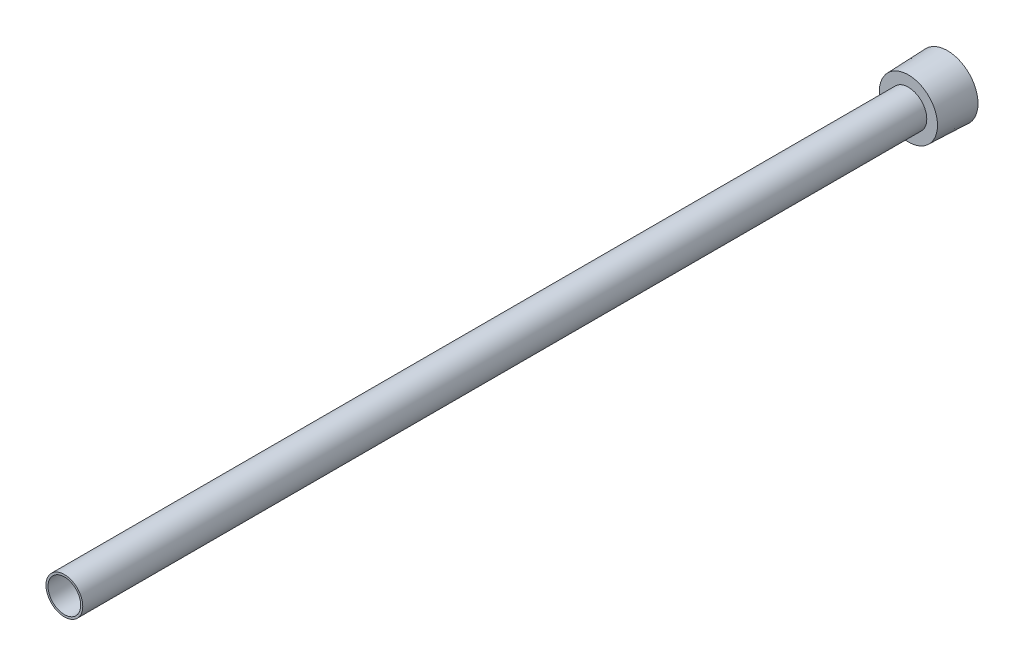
ISO-10303-21;
HEADER;
FILE_DESCRIPTION(('STEP AP214'),'2;1');
FILE_NAME('part.step','',(''),(''),'','','');
FILE_SCHEMA(('AUTOMOTIVE_DESIGN { 1 0 10303 214 1 1 1 1 }'));
ENDSEC;
DATA;
#1=APPLICATION_CONTEXT('core data for automotive mechanical design processes');
#2=APPLICATION_PROTOCOL_DEFINITION('international standard','automotive_design',2000,#1);
#3=PRODUCT_CONTEXT('',#1,'mechanical');
#4=PRODUCT('Part','Part','',(#3));
#5=PRODUCT_RELATED_PRODUCT_CATEGORY('part','',(#4));
#6=PRODUCT_DEFINITION_FORMATION('','',#4);
#7=PRODUCT_DEFINITION_CONTEXT('part definition',#1,'design');
#8=PRODUCT_DEFINITION('design','',#6,#7);
#9=PRODUCT_DEFINITION_SHAPE('','',#8);
#10=(LENGTH_UNIT() NAMED_UNIT(*) SI_UNIT(.MILLI.,.METRE.));
#11=(NAMED_UNIT(*) PLANE_ANGLE_UNIT() SI_UNIT($,.RADIAN.));
#12=(NAMED_UNIT(*) SI_UNIT($,.STERADIAN.) SOLID_ANGLE_UNIT());
#13=UNCERTAINTY_MEASURE_WITH_UNIT(LENGTH_MEASURE(1.E-05),#10,'distance_accuracy_value','');
#14=(GEOMETRIC_REPRESENTATION_CONTEXT(3) GLOBAL_UNCERTAINTY_ASSIGNED_CONTEXT((#13)) GLOBAL_UNIT_ASSIGNED_CONTEXT((#10,
#11,#12)) REPRESENTATION_CONTEXT('',''));
#15=CARTESIAN_POINT('',(0.,0.,0.));
#16=DIRECTION('',(0.,0.,1.));
#17=DIRECTION('',(1.,0.,0.));
#18=AXIS2_PLACEMENT_3D('',#15,#16,#17);
#19=CARTESIAN_POINT('',(0.,0.,0.));
#20=DIRECTION('',(0.,0.,1.));
#21=DIRECTION('',(1.,0.,0.));
#22=AXIS2_PLACEMENT_3D('',#19,#20,#21);
#23=CYLINDRICAL_SURFACE('',#22,5.6388);
#24=CARTESIAN_POINT('',(0.,0.,304.8));
#25=DIRECTION('',(0.,0.,1.));
#26=DIRECTION('',(1.,0.,0.));
#27=AXIS2_PLACEMENT_3D('',#24,#25,#26);
#28=CIRCLE('',#27,5.6388);
#29=CARTESIAN_POINT('',(5.6388,0.,304.8));
#30=VERTEX_POINT('',#29);
#31=EDGE_CURVE('E141',#30,#30,#28,.T.);
#32=CARTESIAN_POINT('',(0.,0.,9.525));
#33=DIRECTION('',(0.,0.,-1.));
#34=DIRECTION('',(-1.,0.,0.));
#35=AXIS2_PLACEMENT_3D('',#32,#33,#34);
#36=CIRCLE('',#35,5.6388);
#37=CARTESIAN_POINT('',(5.6388,0.,9.525));
#38=VERTEX_POINT('',#37);
#39=EDGE_CURVE('E36',#38,#38,#36,.F.);
#40=CARTESIAN_POINT('',(5.6388,0.,304.8));
#41=CARTESIAN_POINT('',(5.6388,0.,301.72421875));
#42=CARTESIAN_POINT('',(5.6388,0.,298.6484375));
#43=CARTESIAN_POINT('',(5.6388,0.,292.496875));
#44=CARTESIAN_POINT('',(5.6388,0.,289.42109375));
#45=CARTESIAN_POINT('',(5.6388,0.,283.26953125));
#46=CARTESIAN_POINT('',(5.6388,0.,280.19375));
#47=CARTESIAN_POINT('',(5.6388,0.,274.0421875));
#48=CARTESIAN_POINT('',(5.6388,0.,270.96640625));
#49=CARTESIAN_POINT('',(5.6388,0.,264.81484375));
#50=CARTESIAN_POINT('',(5.6388,0.,261.7390625));
#51=CARTESIAN_POINT('',(5.6388,0.,255.5875));
#52=CARTESIAN_POINT('',(5.6388,0.,252.51171875));
#53=CARTESIAN_POINT('',(5.6388,0.,246.36015625));
#54=CARTESIAN_POINT('',(5.6388,0.,243.284375));
#55=CARTESIAN_POINT('',(5.6388,0.,237.1328125));
#56=CARTESIAN_POINT('',(5.6388,0.,234.05703125));
#57=CARTESIAN_POINT('',(5.6388,0.,227.90546875));
#58=CARTESIAN_POINT('',(5.6388,0.,224.8296875));
#59=CARTESIAN_POINT('',(5.6388,0.,218.678125));
#60=CARTESIAN_POINT('',(5.6388,0.,215.60234375));
#61=CARTESIAN_POINT('',(5.6388,0.,209.45078125));
#62=CARTESIAN_POINT('',(5.6388,0.,206.375));
#63=CARTESIAN_POINT('',(5.6388,0.,200.2234375));
#64=CARTESIAN_POINT('',(5.6388,0.,197.14765625));
#65=CARTESIAN_POINT('',(5.6388,0.,190.99609375));
#66=CARTESIAN_POINT('',(5.6388,0.,187.9203125));
#67=CARTESIAN_POINT('',(5.6388,0.,181.76875));
#68=CARTESIAN_POINT('',(5.6388,0.,178.69296875));
#69=CARTESIAN_POINT('',(5.6388,0.,172.54140625));
#70=CARTESIAN_POINT('',(5.6388,0.,169.465625));
#71=CARTESIAN_POINT('',(5.6388,0.,163.3140625));
#72=CARTESIAN_POINT('',(5.6388,0.,160.23828125));
#73=CARTESIAN_POINT('',(5.6388,0.,154.08671875));
#74=CARTESIAN_POINT('',(5.6388,0.,151.0109375));
#75=CARTESIAN_POINT('',(5.6388,0.,144.859375));
#76=CARTESIAN_POINT('',(5.6388,0.,141.78359375));
#77=CARTESIAN_POINT('',(5.6388,0.,135.63203125));
#78=CARTESIAN_POINT('',(5.6388,0.,132.55625));
#79=CARTESIAN_POINT('',(5.6388,0.,126.4046875));
#80=CARTESIAN_POINT('',(5.6388,0.,123.32890625));
#81=CARTESIAN_POINT('',(5.6388,0.,117.17734375));
#82=CARTESIAN_POINT('',(5.6388,0.,114.1015625));
#83=CARTESIAN_POINT('',(5.6388,0.,107.95));
#84=CARTESIAN_POINT('',(5.6388,0.,104.87421875));
#85=CARTESIAN_POINT('',(5.6388,0.,98.72265625));
#86=CARTESIAN_POINT('',(5.6388,0.,95.646875));
#87=CARTESIAN_POINT('',(5.6388,0.,89.4953125));
#88=CARTESIAN_POINT('',(5.6388,0.,86.41953125));
#89=CARTESIAN_POINT('',(5.6388,0.,80.26796875));
#90=CARTESIAN_POINT('',(5.6388,0.,77.1921875));
#91=CARTESIAN_POINT('',(5.6388,0.,71.040625));
#92=CARTESIAN_POINT('',(5.6388,0.,67.96484375));
#93=CARTESIAN_POINT('',(5.6388,0.,61.81328125));
#94=CARTESIAN_POINT('',(5.6388,0.,58.7375));
#95=CARTESIAN_POINT('',(5.6388,0.,52.5859375));
#96=CARTESIAN_POINT('',(5.6388,0.,49.51015625));
#97=CARTESIAN_POINT('',(5.6388,0.,43.35859375));
#98=CARTESIAN_POINT('',(5.6388,0.,40.2828125));
#99=CARTESIAN_POINT('',(5.6388,0.,34.13125));
#100=CARTESIAN_POINT('',(5.6388,0.,31.05546875));
#101=CARTESIAN_POINT('',(5.6388,0.,24.90390625));
#102=CARTESIAN_POINT('',(5.6388,0.,21.828125));
#103=CARTESIAN_POINT('',(5.6388,0.,15.6765625));
#104=CARTESIAN_POINT('',(5.6388,0.,12.60078125));
#105=CARTESIAN_POINT('',(5.6388,0.,9.525));
#106=B_SPLINE_CURVE_WITH_KNOTS('',3,(#40,#41,#42,#43,#44,#45,#46,#47,#48,#49,#50,#51,#52,#53,
#54,#55,#56,#57,#58,#59,#60,#61,#62,#63,#64,#65,#66,#67,#68,#69,#70,#71,#72,#73,#74,#75,#76,#77,
#78,#79,#80,#81,#82,#83,#84,#85,#86,#87,#88,#89,#90,#91,#92,#93,#94,#95,#96,#97,#98,#99,#100,
#101,#102,#103,#104,#105),.UNSPECIFIED.,.F.,.F.,(4,2,2,2,2,2,2,2,2,2,2,2,2,2,2,2,2,2,2,2,2,2,2,
2,2,2,2,2,2,2,2,2,4),(0.,9.22734375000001,18.4546875,27.68203125,36.909375,46.13671875,
55.3640625,64.59140625,73.81875,83.04609375,92.2734375,101.50078125,110.728125,119.95546875,
129.1828125,138.41015625,147.6375,156.86484375,166.0921875,175.31953125,184.546875,193.77421875,
203.0015625,212.22890625,221.45625,230.68359375,239.9109375,249.13828125,258.365625,
267.59296875,276.8203125,286.04765625,295.275),.UNSPECIFIED.);
#107=EDGE_CURVE('BSEAM32',#30,#38,#106,.T.);
#108=ORIENTED_EDGE('',*,*,#31,.T.);
#109=ORIENTED_EDGE('',*,*,#39,.F.);
#110=ORIENTED_EDGE('',*,*,#107,.T.);
#111=ORIENTED_EDGE('',*,*,#107,.F.);
#112=EDGE_LOOP('',(#108,#110,#109,#111));
#113=FACE_BOUND('',#112,.T.);
#114=ADVANCED_FACE('F32',(#113),#23,.F.);
#115=CARTESIAN_POINT('',(0.,0.,0.));
#116=DIRECTION('',(0.,0.,1.));
#117=DIRECTION('',(1.,0.,0.));
#118=AXIS2_PLACEMENT_3D('',#115,#116,#117);
#119=PLANE('',#118);
#120=DIRECTION('',(-0.866025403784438,0.5,0.));
#121=VECTOR('',#120,1.);
#122=CARTESIAN_POINT('',(0.,-7.33234841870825,0.));
#123=LINE('',#122,#121);
#124=CARTESIAN_POINT('',(0.,-7.33234841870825,0.));
#125=VERTEX_POINT('',#124);
#126=CARTESIAN_POINT('',(-6.35,-3.66617420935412,0.));
#127=VERTEX_POINT('',#126);
#128=EDGE_CURVE('E123',#125,#127,#123,.T.);
#129=ORIENTED_EDGE('',*,*,#128,.F.);
#130=DIRECTION('',(-0.866025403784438,-0.5,0.));
#131=VECTOR('',#130,1.);
#132=CARTESIAN_POINT('',(6.35,-3.66617420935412,0.));
#133=LINE('',#132,#131);
#134=CARTESIAN_POINT('',(6.35,-3.66617420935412,0.));
#135=VERTEX_POINT('',#134);
#136=EDGE_CURVE('E48',#135,#125,#133,.T.);
#137=ORIENTED_EDGE('',*,*,#136,.F.);
#138=DIRECTION('',(0.,-1.,0.));
#139=VECTOR('',#138,1.);
#140=CARTESIAN_POINT('',(6.35,3.66617420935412,0.));
#141=LINE('',#140,#139);
#142=CARTESIAN_POINT('',(6.35,3.66617420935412,0.));
#143=VERTEX_POINT('',#142);
#144=EDGE_CURVE('E132',#143,#135,#141,.T.);
#145=ORIENTED_EDGE('',*,*,#144,.F.);
#146=DIRECTION('',(0.866025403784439,-0.5,0.));
#147=VECTOR('',#146,1.);
#148=CARTESIAN_POINT('',(0.,7.33234841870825,0.));
#149=LINE('',#148,#147);
#150=CARTESIAN_POINT('',(0.,7.33234841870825,0.));
#151=VERTEX_POINT('',#150);
#152=EDGE_CURVE('E130',#151,#143,#149,.T.);
#153=ORIENTED_EDGE('',*,*,#152,.F.);
#154=DIRECTION('',(0.866025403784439,0.5,0.));
#155=VECTOR('',#154,1.);
#156=CARTESIAN_POINT('',(-6.35,3.66617420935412,0.));
#157=LINE('',#156,#155);
#158=CARTESIAN_POINT('',(-6.35,3.66617420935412,0.));
#159=VERTEX_POINT('',#158);
#160=EDGE_CURVE('E96',#159,#151,#157,.T.);
#161=ORIENTED_EDGE('',*,*,#160,.F.);
#162=DIRECTION('',(0.,1.,0.));
#163=VECTOR('',#162,1.);
#164=CARTESIAN_POINT('',(-6.35,-3.66617420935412,0.));
#165=LINE('',#164,#163);
#166=EDGE_CURVE('E126',#127,#159,#165,.T.);
#167=ORIENTED_EDGE('',*,*,#166,.F.);
#168=EDGE_LOOP('',(#129,#137,#145,#153,#161,#167));
#169=FACE_BOUND('',#168,.T.);
#170=CARTESIAN_POINT('',(0.,0.,0.));
#171=DIRECTION('',(0.,0.,1.));
#172=DIRECTION('',(1.,0.,0.));
#173=AXIS2_PLACEMENT_3D('',#170,#171,#172);
#174=CIRCLE('',#173,10.541);
#175=CARTESIAN_POINT('',(10.541,0.,0.));
#176=VERTEX_POINT('',#175);
#177=EDGE_CURVE('E11',#176,#176,#174,.T.);
#178=ORIENTED_EDGE('',*,*,#177,.F.);
#179=EDGE_LOOP('',(#178));
#180=FACE_BOUND('',#179,.T.);
#181=ADVANCED_FACE('F34',(#169,#180),#119,.F.);
#182=CARTESIAN_POINT('',(0.,0.,0.));
#183=DIRECTION('',(0.,0.,-1.));
#184=DIRECTION('',(-1.,0.,0.));
#185=AXIS2_PLACEMENT_3D('',#182,#183,#184);
#186=CONICAL_SURFACE('',#185,10.541,0.0364599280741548);
#187=CARTESIAN_POINT('',(0.,0.,13.4874));
#188=DIRECTION('',(0.,0.,1.));
#189=DIRECTION('',(1.,0.,0.));
#190=AXIS2_PLACEMENT_3D('',#187,#188,#189);
#191=CIRCLE('',#190,10.0490323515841);
#192=CARTESIAN_POINT('',(10.0490323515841,0.,13.4874));
#193=VERTEX_POINT('',#192);
#194=EDGE_CURVE('E41',#193,#193,#191,.T.);
#195=ORIENTED_EDGE('',*,*,#194,.F.);
#196=EDGE_LOOP('',(#195));
#197=FACE_BOUND('',#196,.T.);
#198=ORIENTED_EDGE('',*,*,#177,.T.);
#199=EDGE_LOOP('',(#198));
#200=FACE_BOUND('',#199,.T.);
#201=ADVANCED_FACE('F155',(#197,#200),#186,.T.);
#202=CARTESIAN_POINT('',(0.,10.0490323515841,13.4874));
#203=DIRECTION('',(0.,0.,-1.));
#204=DIRECTION('',(-1.,0.,0.));
#205=AXIS2_PLACEMENT_3D('',#202,#203,#204);
#206=PLANE('',#205);
#207=CARTESIAN_POINT('',(0.,0.,13.4874));
#208=DIRECTION('',(0.,0.,1.));
#209=DIRECTION('',(1.,0.,0.));
#210=AXIS2_PLACEMENT_3D('',#207,#208,#209);
#211=CIRCLE('',#210,6.35);
#212=CARTESIAN_POINT('',(6.35,0.,13.4874));
#213=VERTEX_POINT('',#212);
#214=EDGE_CURVE('E147',#213,#213,#211,.T.);
#215=ORIENTED_EDGE('',*,*,#214,.F.);
#216=EDGE_LOOP('',(#215));
#217=FACE_BOUND('',#216,.T.);
#218=ORIENTED_EDGE('',*,*,#194,.T.);
#219=EDGE_LOOP('',(#218));
#220=FACE_BOUND('',#219,.T.);
#221=ADVANCED_FACE('F153',(#217,#220),#206,.F.);
#222=CARTESIAN_POINT('',(0.,0.,223.212151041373));
#223=DIRECTION('',(0.,0.,1.));
#224=DIRECTION('',(1.,0.,0.));
#225=AXIS2_PLACEMENT_3D('',#222,#223,#224);
#226=CYLINDRICAL_SURFACE('',#225,6.34999999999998);
#227=CARTESIAN_POINT('',(0.,0.,304.8));
#228=DIRECTION('',(0.,0.,1.));
#229=DIRECTION('',(1.,0.,0.));
#230=AXIS2_PLACEMENT_3D('',#227,#228,#229);
#231=CIRCLE('',#230,6.34999999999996);
#232=CARTESIAN_POINT('',(6.34999999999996,0.,304.8));
#233=VERTEX_POINT('',#232);
#234=EDGE_CURVE('E144',#233,#233,#231,.T.);
#235=ORIENTED_EDGE('',*,*,#234,.F.);
#236=EDGE_LOOP('',(#235));
#237=FACE_BOUND('',#236,.T.);
#238=ORIENTED_EDGE('',*,*,#214,.T.);
#239=EDGE_LOOP('',(#238));
#240=FACE_BOUND('',#239,.T.);
#241=ADVANCED_FACE('F189',(#237,#240),#226,.T.);
#242=CARTESIAN_POINT('',(0.,6.34999999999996,304.8));
#243=DIRECTION('',(0.,0.,-1.));
#244=DIRECTION('',(-1.,0.,0.));
#245=AXIS2_PLACEMENT_3D('',#242,#243,#244);
#246=PLANE('',#245);
#247=ORIENTED_EDGE('',*,*,#31,.F.);
#248=EDGE_LOOP('',(#247));
#249=FACE_BOUND('',#248,.T.);
#250=ORIENTED_EDGE('',*,*,#234,.T.);
#251=EDGE_LOOP('',(#250));
#252=FACE_BOUND('',#251,.T.);
#253=ADVANCED_FACE('F182',(#249,#252),#246,.F.);
#254=CARTESIAN_POINT('',(0.,-7.33234841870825,9.525));
#255=DIRECTION('',(0.,0.,-1.));
#256=DIRECTION('',(-1.,0.,0.));
#257=AXIS2_PLACEMENT_3D('',#254,#255,#256);
#258=PLANE('',#257);
#259=DIRECTION('',(-0.866025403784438,-0.5,0.));
#260=VECTOR('',#259,1.);
#261=CARTESIAN_POINT('',(6.35,-3.66617420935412,9.525));
#262=LINE('',#261,#260);
#263=CARTESIAN_POINT('',(6.35,-3.66617420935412,9.525));
#264=VERTEX_POINT('',#263);
#265=CARTESIAN_POINT('',(0.,-7.33234841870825,9.525));
#266=VERTEX_POINT('',#265);
#267=EDGE_CURVE('E134',#264,#266,#262,.T.);
#268=ORIENTED_EDGE('',*,*,#267,.T.);
#269=DIRECTION('',(-0.866025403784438,0.5,0.));
#270=VECTOR('',#269,1.);
#271=CARTESIAN_POINT('',(0.,-7.33234841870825,9.525));
#272=LINE('',#271,#270);
#273=CARTESIAN_POINT('',(-6.35,-3.66617420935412,9.525));
#274=VERTEX_POINT('',#273);
#275=EDGE_CURVE('E117',#266,#274,#272,.T.);
#276=ORIENTED_EDGE('',*,*,#275,.T.);
#277=DIRECTION('',(0.,1.,0.));
#278=VECTOR('',#277,1.);
#279=CARTESIAN_POINT('',(-6.35,-3.66617420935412,9.525));
#280=LINE('',#279,#278);
#281=CARTESIAN_POINT('',(-6.35,3.66617420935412,9.525));
#282=VERTEX_POINT('',#281);
#283=EDGE_CURVE('E115',#274,#282,#280,.T.);
#284=ORIENTED_EDGE('',*,*,#283,.T.);
#285=DIRECTION('',(0.866025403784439,0.5,0.));
#286=VECTOR('',#285,1.);
#287=CARTESIAN_POINT('',(-6.35,3.66617420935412,9.525));
#288=LINE('',#287,#286);
#289=CARTESIAN_POINT('',(0.,7.33234841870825,9.525));
#290=VERTEX_POINT('',#289);
#291=EDGE_CURVE('E93',#282,#290,#288,.T.);
#292=ORIENTED_EDGE('',*,*,#291,.T.);
#293=DIRECTION('',(0.866025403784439,-0.5,0.));
#294=VECTOR('',#293,1.);
#295=CARTESIAN_POINT('',(0.,7.33234841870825,9.525));
#296=LINE('',#295,#294);
#297=CARTESIAN_POINT('',(6.35,3.66617420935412,9.525));
#298=VERTEX_POINT('',#297);
#299=EDGE_CURVE('E104',#290,#298,#296,.T.);
#300=ORIENTED_EDGE('',*,*,#299,.T.);
#301=DIRECTION('',(0.,-1.,0.));
#302=VECTOR('',#301,1.);
#303=CARTESIAN_POINT('',(6.35,3.66617420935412,9.525));
#304=LINE('',#303,#302);
#305=EDGE_CURVE('E108',#298,#264,#304,.T.);
#306=ORIENTED_EDGE('',*,*,#305,.T.);
#307=EDGE_LOOP('',(#268,#276,#284,#292,#300,#306));
#308=FACE_BOUND('',#307,.T.);
#309=ORIENTED_EDGE('',*,*,#39,.T.);
#310=EDGE_LOOP('',(#309));
#311=FACE_BOUND('',#310,.T.);
#312=ADVANCED_FACE('F111',(#308,#311),#258,.T.);
#313=CARTESIAN_POINT('',(6.35,-3.66617420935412,9.525));
#314=DIRECTION('',(0.5,-0.866025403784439,0.));
#315=DIRECTION('',(0.866025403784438,0.5,0.));
#316=AXIS2_PLACEMENT_3D('',#313,#314,#315);
#317=PLANE('',#316);
#318=ORIENTED_EDGE('',*,*,#136,.T.);
#319=DIRECTION('',(0.,0.,-1.));
#320=VECTOR('',#319,1.);
#321=CARTESIAN_POINT('',(0.,-7.33234841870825,9.525));
#322=LINE('',#321,#320);
#323=EDGE_CURVE('E78',#266,#125,#322,.T.);
#324=ORIENTED_EDGE('',*,*,#323,.F.);
#325=ORIENTED_EDGE('',*,*,#267,.F.);
#326=DIRECTION('',(0.,0.,-1.));
#327=VECTOR('',#326,1.);
#328=CARTESIAN_POINT('',(6.35,-3.66617420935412,9.525));
#329=LINE('',#328,#327);
#330=EDGE_CURVE('E56',#264,#135,#329,.T.);
#331=ORIENTED_EDGE('',*,*,#330,.T.);
#332=EDGE_LOOP('',(#318,#324,#325,#331));
#333=FACE_BOUND('',#332,.T.);
#334=ADVANCED_FACE('F173',(#333),#317,.F.);
#335=CARTESIAN_POINT('',(6.35,3.66617420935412,9.525));
#336=DIRECTION('',(1.,0.,0.));
#337=DIRECTION('',(0.,0.,-1.));
#338=AXIS2_PLACEMENT_3D('',#335,#336,#337);
#339=PLANE('',#338);
#340=ORIENTED_EDGE('',*,*,#144,.T.);
#341=ORIENTED_EDGE('',*,*,#330,.F.);
#342=ORIENTED_EDGE('',*,*,#305,.F.);
#343=DIRECTION('',(0.,0.,-1.));
#344=VECTOR('',#343,1.);
#345=CARTESIAN_POINT('',(6.35,3.66617420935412,9.525));
#346=LINE('',#345,#344);
#347=EDGE_CURVE('E100',#298,#143,#346,.T.);
#348=ORIENTED_EDGE('',*,*,#347,.T.);
#349=EDGE_LOOP('',(#340,#341,#342,#348));
#350=FACE_BOUND('',#349,.T.);
#351=ADVANCED_FACE('F175',(#350),#339,.F.);
#352=CARTESIAN_POINT('',(0.,7.33234841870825,9.525));
#353=DIRECTION('',(0.5,0.866025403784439,0.));
#354=DIRECTION('',(-0.866025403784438,0.5,0.));
#355=AXIS2_PLACEMENT_3D('',#352,#353,#354);
#356=PLANE('',#355);
#357=ORIENTED_EDGE('',*,*,#152,.T.);
#358=ORIENTED_EDGE('',*,*,#347,.F.);
#359=ORIENTED_EDGE('',*,*,#299,.F.);
#360=DIRECTION('',(0.,0.,-1.));
#361=VECTOR('',#360,1.);
#362=CARTESIAN_POINT('',(0.,7.33234841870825,9.525));
#363=LINE('',#362,#361);
#364=EDGE_CURVE('E89',#290,#151,#363,.T.);
#365=ORIENTED_EDGE('',*,*,#364,.T.);
#366=EDGE_LOOP('',(#357,#358,#359,#365));
#367=FACE_BOUND('',#366,.T.);
#368=ADVANCED_FACE('F105',(#367),#356,.F.);
#369=CARTESIAN_POINT('',(-6.35,3.66617420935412,9.525));
#370=DIRECTION('',(-0.5,0.866025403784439,0.));
#371=DIRECTION('',(-0.866025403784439,-0.5,0.));
#372=AXIS2_PLACEMENT_3D('',#369,#370,#371);
#373=PLANE('',#372);
#374=ORIENTED_EDGE('',*,*,#160,.T.);
#375=ORIENTED_EDGE('',*,*,#364,.F.);
#376=ORIENTED_EDGE('',*,*,#291,.F.);
#377=DIRECTION('',(0.,0.,-1.));
#378=VECTOR('',#377,1.);
#379=CARTESIAN_POINT('',(-6.35,3.66617420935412,9.525));
#380=LINE('',#379,#378);
#381=EDGE_CURVE('E101',#282,#159,#380,.T.);
#382=ORIENTED_EDGE('',*,*,#381,.T.);
#383=EDGE_LOOP('',(#374,#375,#376,#382));
#384=FACE_BOUND('',#383,.T.);
#385=ADVANCED_FACE('F91',(#384),#373,.F.);
#386=CARTESIAN_POINT('',(-6.35,-3.66617420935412,9.525));
#387=DIRECTION('',(-1.,0.,0.));
#388=DIRECTION('',(0.,-1.,0.));
#389=AXIS2_PLACEMENT_3D('',#386,#387,#388);
#390=PLANE('',#389);
#391=ORIENTED_EDGE('',*,*,#166,.T.);
#392=ORIENTED_EDGE('',*,*,#381,.F.);
#393=ORIENTED_EDGE('',*,*,#283,.F.);
#394=DIRECTION('',(0.,0.,-1.));
#395=VECTOR('',#394,1.);
#396=CARTESIAN_POINT('',(-6.35,-3.66617420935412,9.525));
#397=LINE('',#396,#395);
#398=EDGE_CURVE('E138',#274,#127,#397,.T.);
#399=ORIENTED_EDGE('',*,*,#398,.T.);
#400=EDGE_LOOP('',(#391,#392,#393,#399));
#401=FACE_BOUND('',#400,.T.);
#402=ADVANCED_FACE('F245',(#401),#390,.F.);
#403=CARTESIAN_POINT('',(0.,-7.33234841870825,9.525));
#404=DIRECTION('',(-0.5,-0.866025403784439,0.));
#405=DIRECTION('',(0.866025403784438,-0.5,0.));
#406=AXIS2_PLACEMENT_3D('',#403,#404,#405);
#407=PLANE('',#406);
#408=ORIENTED_EDGE('',*,*,#128,.T.);
#409=ORIENTED_EDGE('',*,*,#398,.F.);
#410=ORIENTED_EDGE('',*,*,#275,.F.);
#411=ORIENTED_EDGE('',*,*,#323,.T.);
#412=EDGE_LOOP('',(#408,#409,#410,#411));
#413=FACE_BOUND('',#412,.T.);
#414=ADVANCED_FACE('F171',(#413),#407,.F.);
#415=CLOSED_SHELL('',(#114,#181,#201,#221,#241,#253,#312,#334,#351,#368,#385,#402,#414));
#416=MANIFOLD_SOLID_BREP('B2',#415);
#417=ADVANCED_BREP_SHAPE_REPRESENTATION('',(#18,#416),#14);
#418=SHAPE_DEFINITION_REPRESENTATION(#9,#417);
ENDSEC;
END-ISO-10303-21;
